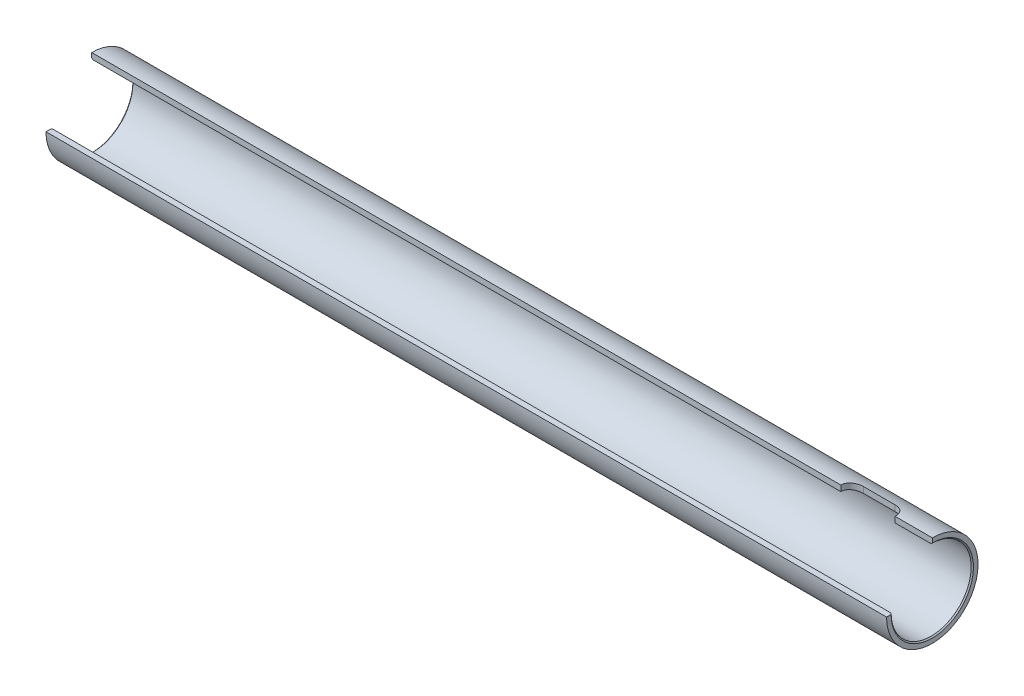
from build123d import *

# Parameters (mm, degrees)
ESQUISSE1_R                  = 8
ESQUISSE1_R_2                = 7
BASE_EXTRUSION_DEPTH         = 147
ENL_V_MAT_EXTRU_1_REACH      = 149.435
ENL_V_MAT_EXTRU_1_END_RADIUS = 8
CHANFREIN1_SIZE              = 0.2
COUPE_REACH                  = 149.435


with BuildPart() as part:
    # Esquisse1 → Base-Extrusion (new body)
    with BuildSketch(Plane(origin=(0, 0, 0), x_dir=(0, 0, -1), z_dir=(1, 0, 0))):
        Circle(ESQUISSE1_R)
        Circle(ESQUISSE1_R_2, mode=Mode.SUBTRACT)
    extrude(amount=-BASE_EXTRUSION_DEPTH)

    # Enl_v. mat.-Extru.1: up to this cylinder (the profile starts inside it)
    enl_v_mat_extru_1_end = Plane(origin=(-11.25, 0, 0), z_dir=(1, 0, 0)) * Cylinder(ENL_V_MAT_EXTRU_1_END_RADIUS, 315.87, mode=Mode.PRIVATE)
    # Esquisse2 → Enl_v. mat.-Extru.1 (cut, up to the surface)
    with BuildSketch(Plane(origin=(0, 0, 0), x_dir=(1, 0, 0), z_dir=(0, 1, 0)), mode=Mode.PRIVATE) as enl_v_mat_extru_1_sk1:
        with BuildLine():
            Line((-14, 2), (-8.5, 2))
            ThreePointArc((-8.5, 2), (-6.5, 0), (-8.5, -2))
            Line((-8.5, -2), (-14, -2))
            ThreePointArc((-14, -2), (-16, 0), (-14, 2))
        make_face()
    enl_v_mat_extru_1_tool1 = extrude(enl_v_mat_extru_1_sk1.sketch, amount=ENL_V_MAT_EXTRU_1_REACH, mode=Mode.PRIVATE) & enl_v_mat_extru_1_end
    add(enl_v_mat_extru_1_tool1.solids().sort_by_distance((-11.25, 0, 0))[0], mode=Mode.SUBTRACT)

    # Chanfrein1
    chanfrein1_edges = [part.edges().sort_by_distance(p)[0] for p in [
        (-147, 0, 7),
        (0, 0, 7),
    ]]
    chamfer(chanfrein1_edges, length=CHANFREIN1_SIZE)

    # Esquisse3 → COUPE (cut, up to next)
    with BuildSketch(Plane(origin=(0, 0, 0), x_dir=(0, 0, -1), z_dir=(1, 0, 0)), mode=Mode.PRIVATE) as coupe_sk1:
        with BuildLine():
            Line((0, 0), (0, 8))
            ThreePointArc((0, 8), (-5.656854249, 5.656854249), (-8, 0))
            Line((-8, 0), (0, 0))
        make_face()
    coupe_tool1 = extrude(coupe_sk1.sketch, amount=-COUPE_REACH, mode=Mode.PRIVATE) & part.part
    add(coupe_tool1.solids().sort_by_distance((0, 3.395305, 3.395305))[0], mode=Mode.SUBTRACT)


solid = part.part
